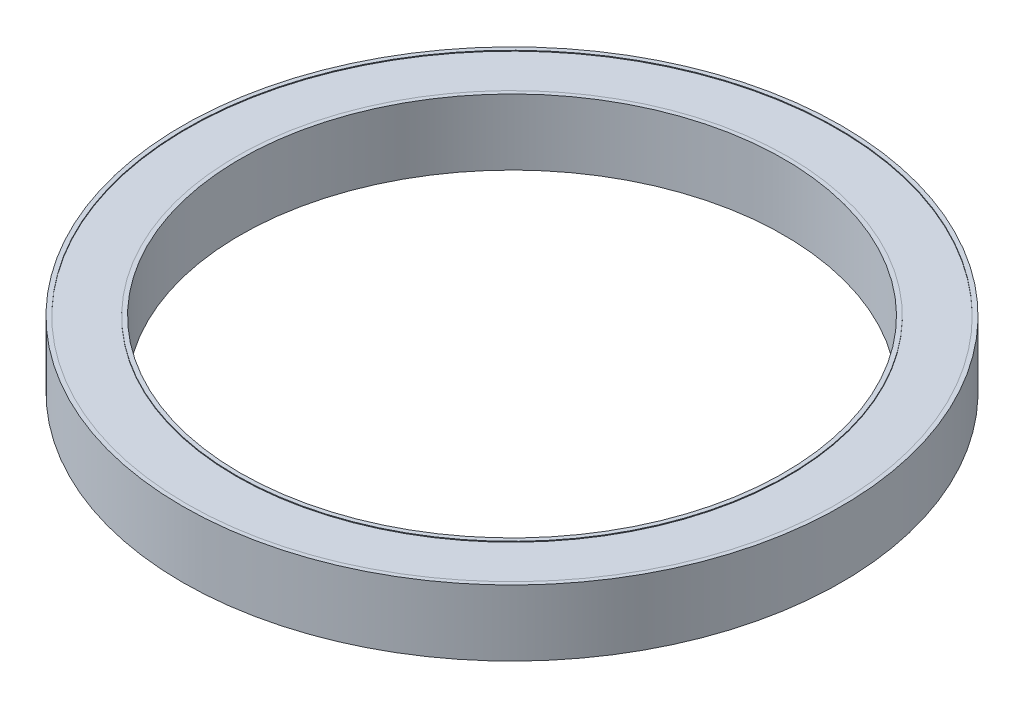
ISO-10303-21;
HEADER;
FILE_DESCRIPTION(('STEP AP214'),'2;1');
FILE_NAME('part.step','',(''),(''),'','','');
FILE_SCHEMA(('AUTOMOTIVE_DESIGN { 1 0 10303 214 1 1 1 1 }'));
ENDSEC;
DATA;
#1=APPLICATION_CONTEXT('core data for automotive mechanical design processes');
#2=APPLICATION_PROTOCOL_DEFINITION('international standard','automotive_design',2000,#1);
#3=PRODUCT_CONTEXT('',#1,'mechanical');
#4=PRODUCT('Part','Part','',(#3));
#5=PRODUCT_RELATED_PRODUCT_CATEGORY('part','',(#4));
#6=PRODUCT_DEFINITION_FORMATION('','',#4);
#7=PRODUCT_DEFINITION_CONTEXT('part definition',#1,'design');
#8=PRODUCT_DEFINITION('design','',#6,#7);
#9=PRODUCT_DEFINITION_SHAPE('','',#8);
#10=(LENGTH_UNIT() NAMED_UNIT(*) SI_UNIT(.MILLI.,.METRE.));
#11=(NAMED_UNIT(*) PLANE_ANGLE_UNIT() SI_UNIT($,.RADIAN.));
#12=(NAMED_UNIT(*) SI_UNIT($,.STERADIAN.) SOLID_ANGLE_UNIT());
#13=UNCERTAINTY_MEASURE_WITH_UNIT(LENGTH_MEASURE(1.E-05),#10,'distance_accuracy_value','');
#14=(GEOMETRIC_REPRESENTATION_CONTEXT(3) GLOBAL_UNCERTAINTY_ASSIGNED_CONTEXT((#13)) GLOBAL_UNIT_ASSIGNED_CONTEXT((#10,
#11,#12)) REPRESENTATION_CONTEXT('',''));
#15=CARTESIAN_POINT('',(0.,0.,0.));
#16=DIRECTION('',(0.,0.,1.));
#17=DIRECTION('',(1.,0.,0.));
#18=AXIS2_PLACEMENT_3D('',#15,#16,#17);
#19=CARTESIAN_POINT('',(0.,0.,0.));
#20=DIRECTION('',(0.,1.,0.));
#21=DIRECTION('',(0.,0.,1.));
#22=AXIS2_PLACEMENT_3D('',#19,#20,#21);
#23=PLANE('',#22);
#24=CARTESIAN_POINT('',(0.,0.,0.));
#25=DIRECTION('',(0.,1.,0.));
#26=DIRECTION('',(0.,0.,1.));
#27=AXIS2_PLACEMENT_3D('',#24,#25,#26);
#28=CIRCLE('',#27,330.);
#29=CARTESIAN_POINT('',(0.,0.,330.));
#30=VERTEX_POINT('',#29);
#31=EDGE_CURVE('E54',#30,#30,#28,.T.);
#32=ORIENTED_EDGE('',*,*,#31,.T.);
#33=EDGE_LOOP('',(#32));
#34=FACE_BOUND('',#33,.T.);
#35=CARTESIAN_POINT('',(0.,0.,0.));
#36=DIRECTION('',(0.,-1.,0.));
#37=DIRECTION('',(0.,0.,-1.));
#38=AXIS2_PLACEMENT_3D('',#35,#36,#37);
#39=CIRCLE('',#38,335.);
#40=CARTESIAN_POINT('',(0.,0.,-335.));
#41=VERTEX_POINT('',#40);
#42=EDGE_CURVE('E86',#41,#41,#39,.T.);
#43=ORIENTED_EDGE('',*,*,#42,.T.);
#44=EDGE_LOOP('',(#43));
#45=FACE_BOUND('',#44,.T.);
#46=ADVANCED_FACE('F39',(#34,#45),#23,.F.);
#47=CARTESIAN_POINT('',(0.,80.,0.));
#48=DIRECTION('',(0.,1.,0.));
#49=DIRECTION('',(0.,0.,1.));
#50=AXIS2_PLACEMENT_3D('',#47,#48,#49);
#51=PLANE('',#50);
#52=CARTESIAN_POINT('',(0.,80.,0.));
#53=DIRECTION('',(0.,1.,0.));
#54=DIRECTION('',(0.,0.,1.));
#55=AXIS2_PLACEMENT_3D('',#52,#53,#54);
#56=CIRCLE('',#55,330.);
#57=CARTESIAN_POINT('',(0.,80.,330.));
#58=VERTEX_POINT('',#57);
#59=EDGE_CURVE('E52',#58,#58,#56,.T.);
#60=ORIENTED_EDGE('',*,*,#59,.F.);
#61=EDGE_LOOP('',(#60));
#62=FACE_BOUND('',#61,.T.);
#63=CARTESIAN_POINT('',(0.,80.,0.));
#64=DIRECTION('',(0.,1.,0.));
#65=DIRECTION('',(0.,0.,1.));
#66=AXIS2_PLACEMENT_3D('',#63,#64,#65);
#67=CIRCLE('',#66,335.);
#68=CARTESIAN_POINT('',(0.,80.,335.));
#69=VERTEX_POINT('',#68);
#70=EDGE_CURVE('E70',#69,#69,#67,.T.);
#71=ORIENTED_EDGE('',*,*,#70,.T.);
#72=EDGE_LOOP('',(#71));
#73=FACE_BOUND('',#72,.T.);
#74=ADVANCED_FACE('F126',(#62,#73),#51,.T.);
#75=CARTESIAN_POINT('',(0.,80.,0.));
#76=DIRECTION('',(0.,1.,0.));
#77=DIRECTION('',(0.,0.,1.));
#78=AXIS2_PLACEMENT_3D('',#75,#76,#77);
#79=CIRCLE('',#78,395.);
#80=CARTESIAN_POINT('',(0.,80.,395.));
#81=VERTEX_POINT('',#80);
#82=EDGE_CURVE('E62',#81,#81,#79,.T.);
#83=ORIENTED_EDGE('',*,*,#82,.F.);
#84=EDGE_LOOP('',(#83));
#85=FACE_BOUND('',#84,.T.);
#86=CARTESIAN_POINT('',(0.,80.,0.));
#87=DIRECTION('',(0.,1.,0.));
#88=DIRECTION('',(0.,0.,1.));
#89=AXIS2_PLACEMENT_3D('',#86,#87,#88);
#90=CIRCLE('',#89,400.);
#91=CARTESIAN_POINT('',(0.,80.,400.));
#92=VERTEX_POINT('',#91);
#93=EDGE_CURVE('E10',#92,#92,#90,.T.);
#94=ORIENTED_EDGE('',*,*,#93,.T.);
#95=EDGE_LOOP('',(#94));
#96=FACE_BOUND('',#95,.T.);
#97=ADVANCED_FACE('F113',(#85,#96),#51,.T.);
#98=CARTESIAN_POINT('',(0.,0.,0.));
#99=DIRECTION('',(0.,-1.,0.));
#100=DIRECTION('',(0.,0.,-1.));
#101=AXIS2_PLACEMENT_3D('',#98,#99,#100);
#102=CIRCLE('',#101,395.);
#103=CARTESIAN_POINT('',(0.,0.,-395.));
#104=VERTEX_POINT('',#103);
#105=EDGE_CURVE('E78',#104,#104,#102,.T.);
#106=ORIENTED_EDGE('',*,*,#105,.F.);
#107=EDGE_LOOP('',(#106));
#108=FACE_BOUND('',#107,.T.);
#109=CARTESIAN_POINT('',(0.,0.,0.));
#110=DIRECTION('',(0.,1.,0.));
#111=DIRECTION('',(0.,0.,1.));
#112=AXIS2_PLACEMENT_3D('',#109,#110,#111);
#113=CIRCLE('',#112,400.);
#114=CARTESIAN_POINT('',(0.,0.,400.));
#115=VERTEX_POINT('',#114);
#116=EDGE_CURVE('E43',#115,#115,#113,.T.);
#117=ORIENTED_EDGE('',*,*,#116,.F.);
#118=EDGE_LOOP('',(#117));
#119=FACE_BOUND('',#118,.T.);
#120=ADVANCED_FACE('F110',(#108,#119),#23,.F.);
#121=CARTESIAN_POINT('',(0.,80.,0.));
#122=DIRECTION('',(0.,-1.,0.));
#123=DIRECTION('',(0.,0.,-1.));
#124=AXIS2_PLACEMENT_3D('',#121,#122,#123);
#125=CYLINDRICAL_SURFACE('',#124,400.);
#126=ORIENTED_EDGE('',*,*,#93,.F.);
#127=EDGE_LOOP('',(#126));
#128=FACE_BOUND('',#127,.T.);
#129=ORIENTED_EDGE('',*,*,#116,.T.);
#130=EDGE_LOOP('',(#129));
#131=FACE_BOUND('',#130,.T.);
#132=ADVANCED_FACE('F41',(#128,#131),#125,.T.);
#133=CARTESIAN_POINT('',(0.,80.,0.));
#134=DIRECTION('',(0.,-1.,0.));
#135=DIRECTION('',(0.,0.,-1.));
#136=AXIS2_PLACEMENT_3D('',#133,#134,#135);
#137=CYLINDRICAL_SURFACE('',#136,330.);
#138=ORIENTED_EDGE('',*,*,#59,.T.);
#139=EDGE_LOOP('',(#138));
#140=FACE_BOUND('',#139,.T.);
#141=ORIENTED_EDGE('',*,*,#31,.F.);
#142=EDGE_LOOP('',(#141));
#143=FACE_BOUND('',#142,.T.);
#144=ADVANCED_FACE('F117',(#140,#143),#137,.F.);
#145=CARTESIAN_POINT('',(0.,79.,0.));
#146=DIRECTION('',(0.,1.,0.));
#147=DIRECTION('',(0.,0.,1.));
#148=AXIS2_PLACEMENT_3D('',#145,#146,#147);
#149=CYLINDRICAL_SURFACE('',#148,395.);
#150=CARTESIAN_POINT('',(0.,79.,0.));
#151=DIRECTION('',(0.,1.,0.));
#152=DIRECTION('',(0.,0.,1.));
#153=AXIS2_PLACEMENT_3D('',#150,#151,#152);
#154=CIRCLE('',#153,395.);
#155=CARTESIAN_POINT('',(0.,79.,395.));
#156=VERTEX_POINT('',#155);
#157=EDGE_CURVE('E58',#156,#156,#154,.T.);
#158=ORIENTED_EDGE('',*,*,#157,.F.);
#159=EDGE_LOOP('',(#158));
#160=FACE_BOUND('',#159,.T.);
#161=ORIENTED_EDGE('',*,*,#82,.T.);
#162=EDGE_LOOP('',(#161));
#163=FACE_BOUND('',#162,.T.);
#164=ADVANCED_FACE('F122',(#160,#163),#149,.F.);
#165=CARTESIAN_POINT('',(0.,79.,0.));
#166=DIRECTION('',(0.,1.,0.));
#167=DIRECTION('',(0.,0.,1.));
#168=AXIS2_PLACEMENT_3D('',#165,#166,#167);
#169=PLANE('',#168);
#170=CARTESIAN_POINT('',(0.,79.,0.));
#171=DIRECTION('',(0.,1.,0.));
#172=DIRECTION('',(0.,0.,1.));
#173=AXIS2_PLACEMENT_3D('',#170,#171,#172);
#174=CIRCLE('',#173,335.);
#175=CARTESIAN_POINT('',(0.,79.,335.));
#176=VERTEX_POINT('',#175);
#177=EDGE_CURVE('E66',#176,#176,#174,.T.);
#178=ORIENTED_EDGE('',*,*,#177,.F.);
#179=EDGE_LOOP('',(#178));
#180=FACE_BOUND('',#179,.T.);
#181=ORIENTED_EDGE('',*,*,#157,.T.);
#182=EDGE_LOOP('',(#181));
#183=FACE_BOUND('',#182,.T.);
#184=ADVANCED_FACE('F139',(#180,#183),#169,.T.);
#185=CARTESIAN_POINT('',(0.,79.,0.));
#186=DIRECTION('',(0.,1.,0.));
#187=DIRECTION('',(0.,0.,1.));
#188=AXIS2_PLACEMENT_3D('',#185,#186,#187);
#189=CYLINDRICAL_SURFACE('',#188,335.);
#190=ORIENTED_EDGE('',*,*,#177,.T.);
#191=EDGE_LOOP('',(#190));
#192=FACE_BOUND('',#191,.T.);
#193=ORIENTED_EDGE('',*,*,#70,.F.);
#194=EDGE_LOOP('',(#193));
#195=FACE_BOUND('',#194,.T.);
#196=ADVANCED_FACE('F106',(#192,#195),#189,.T.);
#197=CARTESIAN_POINT('',(0.,25.,0.));
#198=DIRECTION('',(0.,-1.,0.));
#199=DIRECTION('',(0.,0.,-1.));
#200=AXIS2_PLACEMENT_3D('',#197,#198,#199);
#201=CYLINDRICAL_SURFACE('',#200,395.);
#202=CARTESIAN_POINT('',(0.,25.,0.));
#203=DIRECTION('',(0.,-1.,0.));
#204=DIRECTION('',(0.,0.,-1.));
#205=AXIS2_PLACEMENT_3D('',#202,#203,#204);
#206=CIRCLE('',#205,395.);
#207=CARTESIAN_POINT('',(0.,25.,-395.));
#208=VERTEX_POINT('',#207);
#209=EDGE_CURVE('E74',#208,#208,#206,.T.);
#210=ORIENTED_EDGE('',*,*,#209,.F.);
#211=EDGE_LOOP('',(#210));
#212=FACE_BOUND('',#211,.T.);
#213=ORIENTED_EDGE('',*,*,#105,.T.);
#214=EDGE_LOOP('',(#213));
#215=FACE_BOUND('',#214,.T.);
#216=ADVANCED_FACE('F100',(#212,#215),#201,.F.);
#217=CARTESIAN_POINT('',(0.,25.,0.));
#218=DIRECTION('',(0.,-1.,0.));
#219=DIRECTION('',(0.,0.,-1.));
#220=AXIS2_PLACEMENT_3D('',#217,#218,#219);
#221=PLANE('',#220);
#222=CARTESIAN_POINT('',(0.,25.,0.));
#223=DIRECTION('',(0.,-1.,0.));
#224=DIRECTION('',(0.,0.,-1.));
#225=AXIS2_PLACEMENT_3D('',#222,#223,#224);
#226=CIRCLE('',#225,335.);
#227=CARTESIAN_POINT('',(0.,25.,-335.));
#228=VERTEX_POINT('',#227);
#229=EDGE_CURVE('E82',#228,#228,#226,.T.);
#230=ORIENTED_EDGE('',*,*,#229,.F.);
#231=EDGE_LOOP('',(#230));
#232=FACE_BOUND('',#231,.T.);
#233=ORIENTED_EDGE('',*,*,#209,.T.);
#234=EDGE_LOOP('',(#233));
#235=FACE_BOUND('',#234,.T.);
#236=ADVANCED_FACE('F97',(#232,#235),#221,.T.);
#237=CARTESIAN_POINT('',(0.,25.,0.));
#238=DIRECTION('',(0.,-1.,0.));
#239=DIRECTION('',(0.,0.,-1.));
#240=AXIS2_PLACEMENT_3D('',#237,#238,#239);
#241=CYLINDRICAL_SURFACE('',#240,335.);
#242=ORIENTED_EDGE('',*,*,#229,.T.);
#243=EDGE_LOOP('',(#242));
#244=FACE_BOUND('',#243,.T.);
#245=ORIENTED_EDGE('',*,*,#42,.F.);
#246=EDGE_LOOP('',(#245));
#247=FACE_BOUND('',#246,.T.);
#248=ADVANCED_FACE('F94',(#244,#247),#241,.T.);
#249=CLOSED_SHELL('',(#46,#74,#97,#120,#132,#144,#164,#184,#196,#216,#236,#248));
#250=MANIFOLD_SOLID_BREP('B2',#249);
#251=ADVANCED_BREP_SHAPE_REPRESENTATION('',(#18,#250),#14);
#252=SHAPE_DEFINITION_REPRESENTATION(#9,#251);
ENDSEC;
END-ISO-10303-21;
